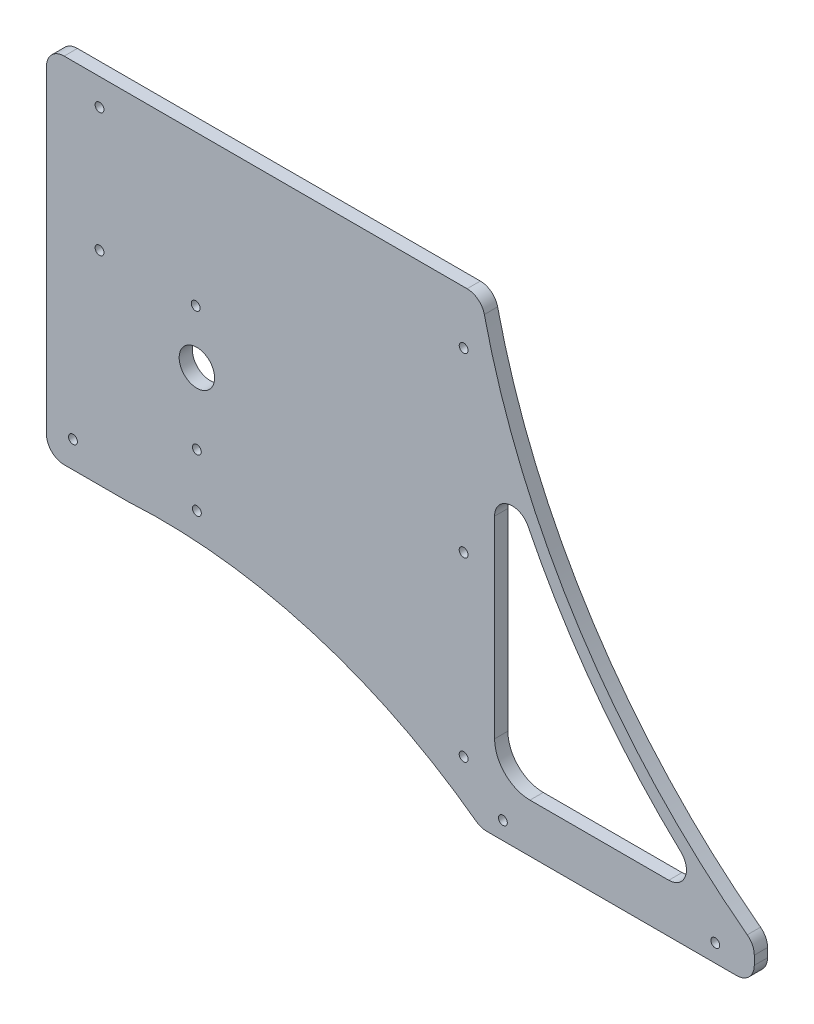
from build123d import *

# Parameters (mm, degrees)
BOSS_EXTRUDE1_DEPTH = 9.525
SKETCH2_R           = 3.175
SKETCH2_R_2         = 12.7
CUT_EXTRUDE1_DEPTH  = 754.856855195
CUT_EXTRUDE2_DEPTH  = 754.856855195
FILLET1_R           = 12.7
FILLET2_R           = 12.7


with BuildPart() as part:
    # Sketch1 → Boss-Extrude1 (new body)
    with BuildSketch(Plane.XY):
        Polygon((-133.35, 654.1), (-133.35, 323.9), (374.65, 323.9), (374.65, 348.9), (374.65, 654.1), align=None)
    extrude(amount=BOSS_EXTRUDE1_DEPTH)

    # Sketch2 → Cut-Extrude1 (cut, through all)
    with BuildSketch(Plane.XY.offset(9.525)):
        with Locations((-95.25, 635)):
            Circle(SKETCH2_R)
        with Locations((-95.25, 546.1)):
            Circle(SKETCH2_R)
        with Locations((-26.252614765, 546.090458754)):
            Circle(SKETCH2_R)
        with Locations((-25.4, 508)):
            Circle(SKETCH2_R_2)
        with Locations((-114.3, 419.1)):
            Circle(SKETCH2_R)
        with Locations((-25.4, 419.1)):
            Circle(SKETCH2_R)
        with Locations((-25.4, 457.2)):
            Circle(SKETCH2_R)
        with BuildLine():
            ThreePointArc((169.224610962, 616), (168.294674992, 618.24506403), (166.049610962, 619.175))
            Line((166.049610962, 619.175), (166.049610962, 612.825))
            ThreePointArc((166.049610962, 612.825), (168.294674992, 613.75493597), (169.224610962, 616))
        make_face()
        with BuildLine():
            Line((166.049610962, 612.825), (166.049610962, 619.175))
            ThreePointArc((166.049610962, 619.175), (162.874610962, 616), (166.049610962, 612.825))
        make_face()
        with BuildLine():
            ThreePointArc((169.224610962, 616), (168.294674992, 618.24506403), (166.049610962, 619.175))
            Line((166.049610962, 619.175), (166.049610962, 612.825))
            ThreePointArc((166.049610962, 612.825), (168.294674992, 613.75493597), (169.224610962, 616))
        make_face()
        with BuildLine():
            Line((166.049610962, 612.825), (166.049610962, 619.175))
            ThreePointArc((166.049610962, 619.175), (162.874610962, 616), (166.049610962, 612.825))
        make_face()
        with BuildLine():
            ThreePointArc((169.224610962, 489), (168.294674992, 491.24506403), (166.049610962, 492.175))
            Line((166.049610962, 492.175), (166.049610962, 485.825))
            ThreePointArc((166.049610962, 485.825), (168.294674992, 486.75493597), (169.224610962, 489))
        make_face()
        with BuildLine():
            Line((166.049610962, 485.825), (166.049610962, 492.175))
            ThreePointArc((166.049610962, 492.175), (162.874610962, 489), (166.049610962, 485.825))
        make_face()
        with BuildLine():
            ThreePointArc((169.224610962, 489), (168.294674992, 491.24506403), (166.049610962, 492.175))
            Line((166.049610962, 492.175), (166.049610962, 485.825))
            ThreePointArc((166.049610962, 485.825), (168.294674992, 486.75493597), (169.224610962, 489))
        make_face()
        with BuildLine():
            Line((166.049610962, 485.825), (166.049610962, 492.175))
            ThreePointArc((166.049610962, 492.175), (162.874610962, 489), (166.049610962, 485.825))
        make_face()
        with BuildLine():
            ThreePointArc((169.224610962, 362), (168.294674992, 364.24506403), (166.049610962, 365.175))
            Line((166.049610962, 365.175), (166.049610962, 358.825))
            ThreePointArc((166.049610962, 358.825), (168.294674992, 359.75493597), (169.224610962, 362))
        make_face()
        with BuildLine():
            Line((166.049610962, 358.825), (166.049610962, 365.175))
            ThreePointArc((166.049610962, 365.175), (162.874610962, 362), (166.049610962, 358.825))
        make_face()
        with BuildLine():
            ThreePointArc((169.224610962, 362), (168.294674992, 364.24506403), (166.049610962, 365.175))
            Line((166.049610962, 365.175), (166.049610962, 358.825))
            ThreePointArc((166.049610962, 358.825), (168.294674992, 359.75493597), (169.224610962, 362))
        make_face()
        with BuildLine():
            Line((166.049610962, 358.825), (166.049610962, 365.175))
            ThreePointArc((166.049610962, 365.175), (162.874610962, 362), (166.049610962, 358.825))
        make_face()
        with BuildLine():
            ThreePointArc((197.416216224, 336.6), (194.241216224, 339.775), (191.066216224, 336.6))
            Line((191.066216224, 336.6), (197.416216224, 336.6))
        make_face()
        with BuildLine():
            Line((197.416216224, 336.6), (191.066216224, 336.6))
            ThreePointArc((191.066216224, 336.6), (194.241216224, 333.425), (197.416216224, 336.6))
        make_face()
        with BuildLine():
            ThreePointArc((197.416216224, 336.6), (194.241216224, 339.775), (191.066216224, 336.6))
            Line((191.066216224, 336.6), (197.416216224, 336.6))
        make_face()
        with BuildLine():
            Line((197.416216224, 336.6), (191.066216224, 336.6))
            ThreePointArc((191.066216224, 336.6), (194.241216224, 333.425), (197.416216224, 336.6))
        make_face()
        with Locations((346.641216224, 336.6)):
            Circle(SKETCH2_R)
    extrude(amount=-CUT_EXTRUDE1_DEPTH, mode=Mode.SUBTRACT)

    # Sketch3 → Cut-Extrude2 (cut, through all)
    with BuildSketch(Plane.XY.offset(9.525)):
        with BuildLine():
            Line((-133.35, 400.1), (-133.35, 323.9))
            Line((-133.35, 323.9), (178.349610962, 323.9))
            ThreePointArc((178.349610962, 323.9), (58.684690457, 384.627610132), (-74.6125, 400.1))
            Line((-74.6125, 400.1), (-133.35, 400.1))
        make_face()
        with BuildLine():
            ThreePointArc((178.749610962, 654.1), (248.601635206, 483.640805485), (374.65, 349.3))
            Line((374.65, 349.3), (374.65, 654.1))
            Line((374.65, 654.1), (178.749610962, 654.1))
        make_face()
        with BuildLine():
            ThreePointArc((346.935179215, 358.825), (252.224488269, 461.165456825), (188.274610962, 585.077107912))
            Line((188.274610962, 585.077107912), (188.274610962, 384.225))
            ThreePointArc((188.274610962, 384.225), (195.71409872, 366.264487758), (213.674610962, 358.825))
            Line((213.674610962, 358.825), (346.935179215, 358.825))
        make_face()
    extrude(amount=-CUT_EXTRUDE2_DEPTH, mode=Mode.SUBTRACT)

    # Fillet1
    fillet1_edges = [part.edges().sort_by_distance(p)[0] for p in [
        (178.349610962, 323.9, 4.7625),
        (-133.35, 400.1, 4.7625),
        (374.65, 323.9, 4.7625),
        (374.65, 349.3, 4.7625),
        (178.749610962, 654.1, 4.7625),
        (-133.35, 654.1, 4.7625),
    ]]
    fillet(fillet1_edges, radius=FILLET1_R)

    # Fillet2
    fillet2_edges = [part.edges().sort_by_distance(p)[0] for p in [
        (188.274610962, 585.077107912, 4.7625),
        (346.935179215, 358.825, 4.7625),
    ]]
    fillet(fillet2_edges, radius=FILLET2_R)


solid = part.part
